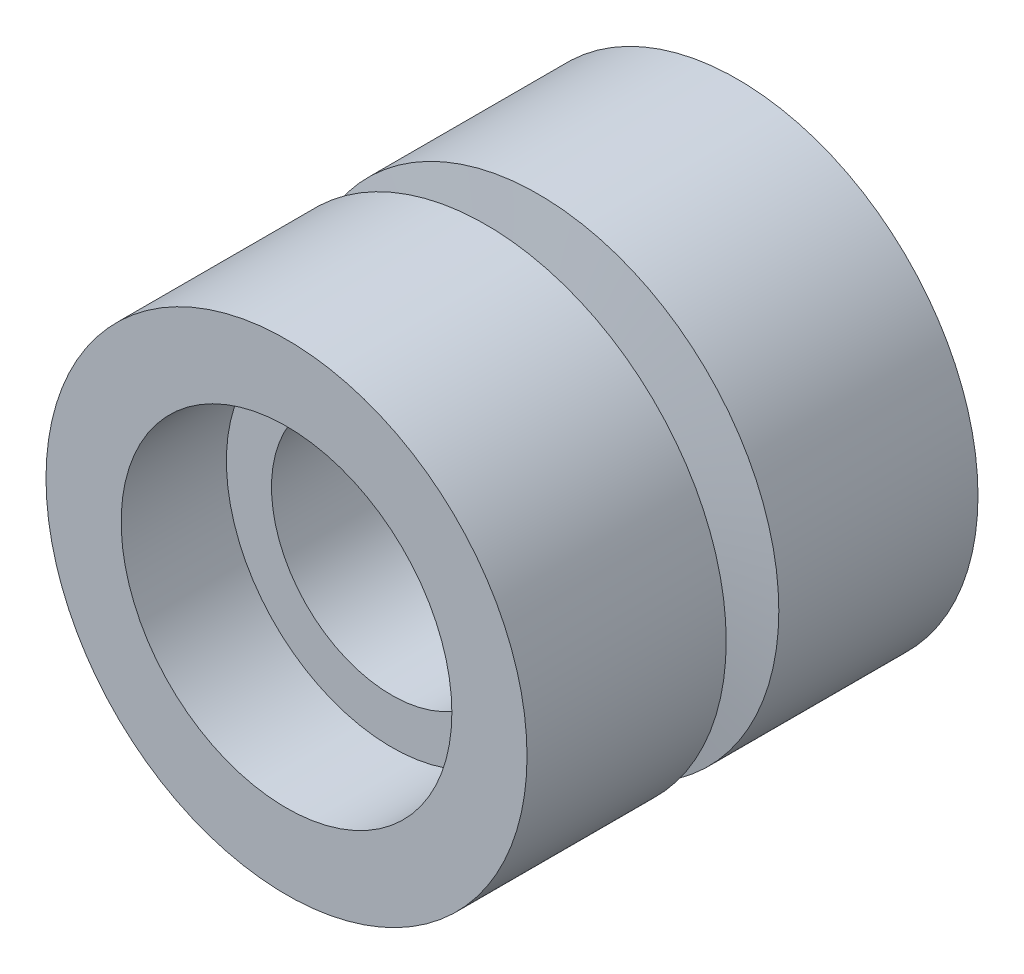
from build123d import *


with BuildPart() as part:
    # Esquisse1 → R_volution1 (revolve)
    with BuildSketch(Plane(origin=(0, 0, 0), x_dir=(0, 0, -1), z_dir=(1, 0, 0)), mode=Mode.PRIVATE) as r_volution1_sk:
        Polygon((-15, 11), (-15, 16), (-1.75, 16), (-1.117566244, 11.5), (1.117566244, 11.5), (1.75, 16), (15, 16), (15, 11), (8, 11), (8, 8), (-8, 8), (-8, 11), align=None)
    revolve(r_volution1_sk.sketch.rotate(Axis((0, 0, 21.700778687), (0, 0, -1)), 90), axis=Axis((0, 0, 21.700778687), (0, 0, -1)))


solid = part.part
